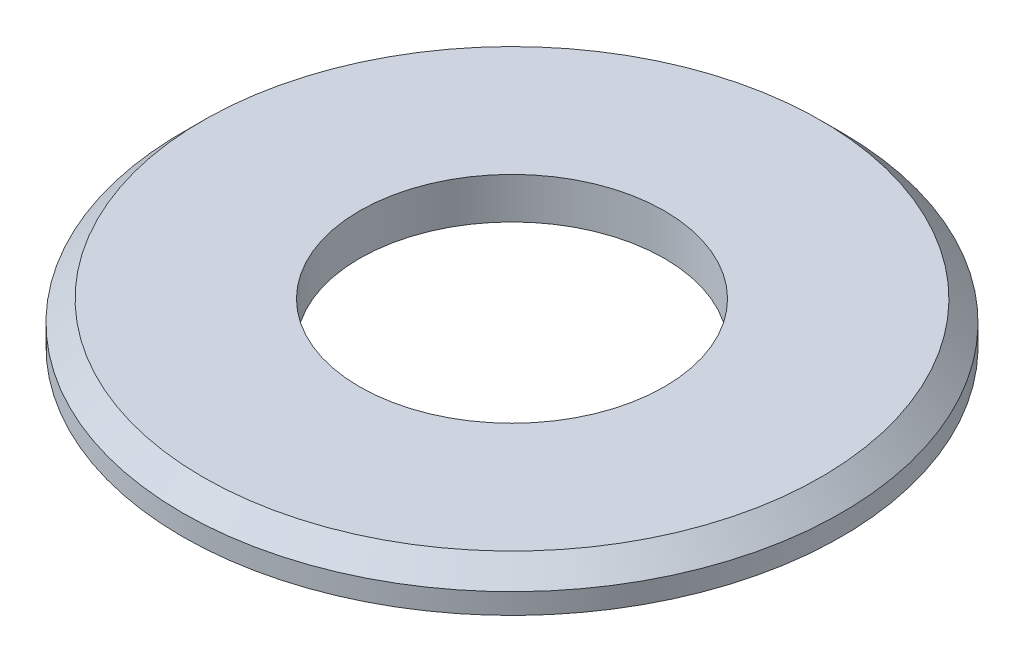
ISO-10303-21;
HEADER;
FILE_DESCRIPTION(('STEP AP214'),'2;1');
FILE_NAME('part.step','',(''),(''),'','','');
FILE_SCHEMA(('AUTOMOTIVE_DESIGN { 1 0 10303 214 1 1 1 1 }'));
ENDSEC;
DATA;
#1=APPLICATION_CONTEXT('core data for automotive mechanical design processes');
#2=APPLICATION_PROTOCOL_DEFINITION('international standard','automotive_design',2000,#1);
#3=PRODUCT_CONTEXT('',#1,'mechanical');
#4=PRODUCT('Part','Part','',(#3));
#5=PRODUCT_RELATED_PRODUCT_CATEGORY('part','',(#4));
#6=PRODUCT_DEFINITION_FORMATION('','',#4);
#7=PRODUCT_DEFINITION_CONTEXT('part definition',#1,'design');
#8=PRODUCT_DEFINITION('design','',#6,#7);
#9=PRODUCT_DEFINITION_SHAPE('','',#8);
#10=(LENGTH_UNIT() NAMED_UNIT(*) SI_UNIT(.MILLI.,.METRE.));
#11=(NAMED_UNIT(*) PLANE_ANGLE_UNIT() SI_UNIT($,.RADIAN.));
#12=(NAMED_UNIT(*) SI_UNIT($,.STERADIAN.) SOLID_ANGLE_UNIT());
#13=UNCERTAINTY_MEASURE_WITH_UNIT(LENGTH_MEASURE(1.E-05),#10,'distance_accuracy_value','');
#14=(GEOMETRIC_REPRESENTATION_CONTEXT(3) GLOBAL_UNCERTAINTY_ASSIGNED_CONTEXT((#13)) GLOBAL_UNIT_ASSIGNED_CONTEXT((#10,
#11,#12)) REPRESENTATION_CONTEXT('',''));
#15=CARTESIAN_POINT('',(0.,0.,0.));
#16=DIRECTION('',(0.,0.,1.));
#17=DIRECTION('',(1.,0.,0.));
#18=AXIS2_PLACEMENT_3D('',#15,#16,#17);
#19=CARTESIAN_POINT('',(0.,0.5,0.));
#20=DIRECTION('',(0.,1.,0.));
#21=DIRECTION('',(0.,0.,1.));
#22=AXIS2_PLACEMENT_3D('',#19,#20,#21);
#23=PLANE('',#22);
#24=CARTESIAN_POINT('',(0.,0.5,0.));
#25=DIRECTION('',(0.,1.,0.));
#26=DIRECTION('',(0.,0.,1.));
#27=AXIS2_PLACEMENT_3D('',#24,#25,#26);
#28=CIRCLE('',#27,3.75);
#29=CARTESIAN_POINT('',(0.,0.5,3.75));
#30=VERTEX_POINT('',#29);
#31=EDGE_CURVE('E35',#30,#30,#28,.T.);
#32=ORIENTED_EDGE('',*,*,#31,.T.);
#33=EDGE_LOOP('',(#32));
#34=FACE_BOUND('',#33,.T.);
#35=CARTESIAN_POINT('',(0.,0.5,0.));
#36=DIRECTION('',(0.,1.,0.));
#37=DIRECTION('',(0.,0.,1.));
#38=AXIS2_PLACEMENT_3D('',#35,#36,#37);
#39=CIRCLE('',#38,1.85);
#40=CARTESIAN_POINT('',(0.,0.5,1.85));
#41=VERTEX_POINT('',#40);
#42=EDGE_CURVE('E43',#41,#41,#39,.T.);
#43=ORIENTED_EDGE('',*,*,#42,.F.);
#44=EDGE_LOOP('',(#43));
#45=FACE_BOUND('',#44,.T.);
#46=ADVANCED_FACE('F28',(#34,#45),#23,.T.);
#47=CARTESIAN_POINT('',(0.,0.,0.));
#48=DIRECTION('',(0.,1.,0.));
#49=DIRECTION('',(0.,0.,1.));
#50=AXIS2_PLACEMENT_3D('',#47,#48,#49);
#51=PLANE('',#50);
#52=CARTESIAN_POINT('',(0.,0.,0.));
#53=DIRECTION('',(0.,1.,0.));
#54=DIRECTION('',(0.,0.,1.));
#55=AXIS2_PLACEMENT_3D('',#52,#53,#54);
#56=CIRCLE('',#55,4.);
#57=CARTESIAN_POINT('',(0.,0.,4.));
#58=VERTEX_POINT('',#57);
#59=EDGE_CURVE('E39',#58,#58,#56,.T.);
#60=ORIENTED_EDGE('',*,*,#59,.F.);
#61=EDGE_LOOP('',(#60));
#62=FACE_BOUND('',#61,.T.);
#63=CARTESIAN_POINT('',(0.,0.,0.));
#64=DIRECTION('',(0.,1.,0.));
#65=DIRECTION('',(0.,0.,1.));
#66=AXIS2_PLACEMENT_3D('',#63,#64,#65);
#67=CIRCLE('',#66,1.85);
#68=CARTESIAN_POINT('',(0.,0.,1.85));
#69=VERTEX_POINT('',#68);
#70=EDGE_CURVE('E48',#69,#69,#67,.T.);
#71=ORIENTED_EDGE('',*,*,#70,.T.);
#72=EDGE_LOOP('',(#71));
#73=FACE_BOUND('',#72,.T.);
#74=ADVANCED_FACE('F52',(#62,#73),#51,.F.);
#75=CARTESIAN_POINT('',(0.,0.5,0.));
#76=DIRECTION('',(0.,-1.,0.));
#77=DIRECTION('',(0.,0.,-1.));
#78=AXIS2_PLACEMENT_3D('',#75,#76,#77);
#79=CYLINDRICAL_SURFACE('',#78,4.);
#80=CARTESIAN_POINT('',(0.,0.25,0.));
#81=DIRECTION('',(0.,1.,0.));
#82=DIRECTION('',(0.,0.,1.));
#83=AXIS2_PLACEMENT_3D('',#80,#81,#82);
#84=CIRCLE('',#83,4.);
#85=CARTESIAN_POINT('',(0.,0.25,4.));
#86=VERTEX_POINT('',#85);
#87=EDGE_CURVE('E10',#86,#86,#84,.F.);
#88=ORIENTED_EDGE('',*,*,#87,.T.);
#89=EDGE_LOOP('',(#88));
#90=FACE_BOUND('',#89,.T.);
#91=ORIENTED_EDGE('',*,*,#59,.T.);
#92=EDGE_LOOP('',(#91));
#93=FACE_BOUND('',#92,.T.);
#94=ADVANCED_FACE('F30',(#90,#93),#79,.T.);
#95=CARTESIAN_POINT('',(0.,0.5,0.));
#96=DIRECTION('',(0.,-1.,0.));
#97=DIRECTION('',(0.,0.,-1.));
#98=AXIS2_PLACEMENT_3D('',#95,#96,#97);
#99=CYLINDRICAL_SURFACE('',#98,1.85);
#100=ORIENTED_EDGE('',*,*,#42,.T.);
#101=EDGE_LOOP('',(#100));
#102=FACE_BOUND('',#101,.T.);
#103=ORIENTED_EDGE('',*,*,#70,.F.);
#104=EDGE_LOOP('',(#103));
#105=FACE_BOUND('',#104,.T.);
#106=ADVANCED_FACE('F54',(#102,#105),#99,.F.);
#107=CARTESIAN_POINT('',(0.,0.5,0.));
#108=DIRECTION('',(0.,-1.,0.));
#109=DIRECTION('',(0.,0.,-1.));
#110=AXIS2_PLACEMENT_3D('',#107,#108,#109);
#111=CONICAL_SURFACE('',#110,3.75,0.785398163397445);
#112=ORIENTED_EDGE('',*,*,#87,.F.);
#113=EDGE_LOOP('',(#112));
#114=FACE_BOUND('',#113,.T.);
#115=ORIENTED_EDGE('',*,*,#31,.F.);
#116=EDGE_LOOP('',(#115));
#117=FACE_BOUND('',#116,.T.);
#118=ADVANCED_FACE('F56',(#114,#117),#111,.T.);
#119=CLOSED_SHELL('',(#46,#74,#94,#106,#118));
#120=MANIFOLD_SOLID_BREP('B2',#119);
#121=ADVANCED_BREP_SHAPE_REPRESENTATION('',(#18,#120),#14);
#122=SHAPE_DEFINITION_REPRESENTATION(#9,#121);
ENDSEC;
END-ISO-10303-21;
